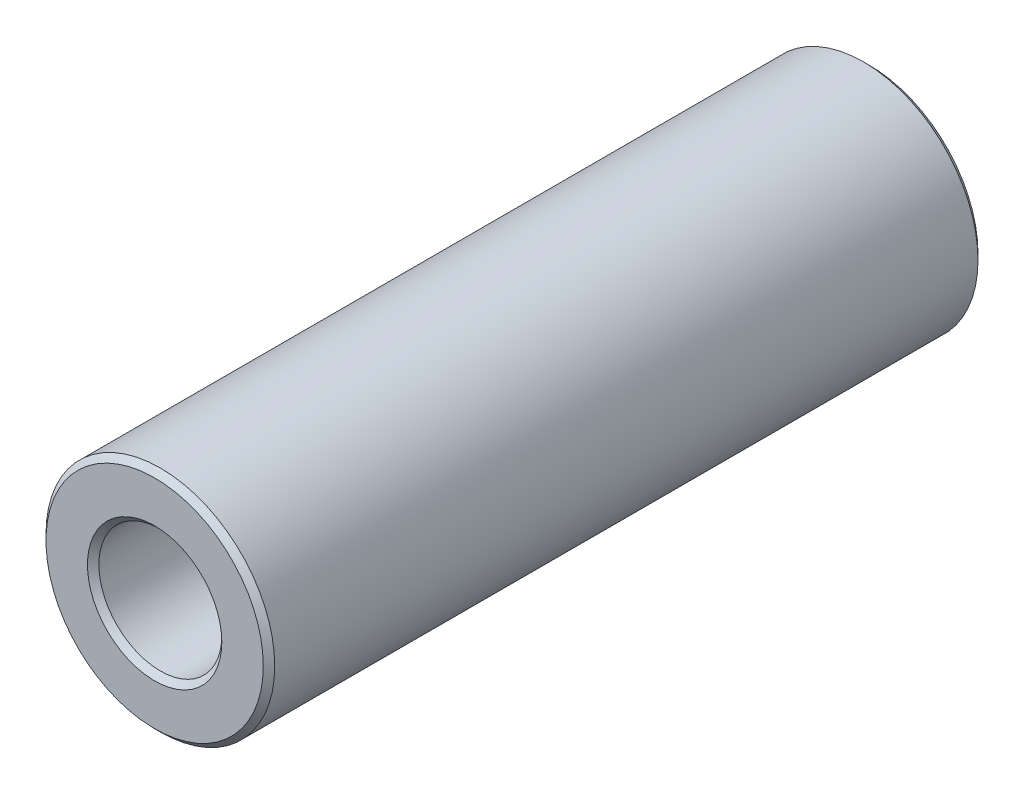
ISO-10303-21;
HEADER;
FILE_DESCRIPTION(('STEP AP214'),'2;1');
FILE_NAME('part.step','',(''),(''),'','','');
FILE_SCHEMA(('AUTOMOTIVE_DESIGN { 1 0 10303 214 1 1 1 1 }'));
ENDSEC;
DATA;
#1=APPLICATION_CONTEXT('core data for automotive mechanical design processes');
#2=APPLICATION_PROTOCOL_DEFINITION('international standard','automotive_design',2000,#1);
#3=PRODUCT_CONTEXT('',#1,'mechanical');
#4=PRODUCT('Part','Part','',(#3));
#5=PRODUCT_RELATED_PRODUCT_CATEGORY('part','',(#4));
#6=PRODUCT_DEFINITION_FORMATION('','',#4);
#7=PRODUCT_DEFINITION_CONTEXT('part definition',#1,'design');
#8=PRODUCT_DEFINITION('design','',#6,#7);
#9=PRODUCT_DEFINITION_SHAPE('','',#8);
#10=(LENGTH_UNIT() NAMED_UNIT(*) SI_UNIT(.MILLI.,.METRE.));
#11=(NAMED_UNIT(*) PLANE_ANGLE_UNIT() SI_UNIT($,.RADIAN.));
#12=(NAMED_UNIT(*) SI_UNIT($,.STERADIAN.) SOLID_ANGLE_UNIT());
#13=UNCERTAINTY_MEASURE_WITH_UNIT(LENGTH_MEASURE(1.E-05),#10,'distance_accuracy_value','');
#14=(GEOMETRIC_REPRESENTATION_CONTEXT(3) GLOBAL_UNCERTAINTY_ASSIGNED_CONTEXT((#13)) GLOBAL_UNIT_ASSIGNED_CONTEXT((#10,
#11,#12)) REPRESENTATION_CONTEXT('',''));
#15=CARTESIAN_POINT('',(0.,0.,0.));
#16=DIRECTION('',(0.,0.,1.));
#17=DIRECTION('',(1.,0.,0.));
#18=AXIS2_PLACEMENT_3D('',#15,#16,#17);
#19=CARTESIAN_POINT('',(0.,0.,12.5));
#20=DIRECTION('',(0.,0.,1.));
#21=DIRECTION('',(1.,0.,0.));
#22=AXIS2_PLACEMENT_3D('',#19,#20,#21);
#23=PLANE('',#22);
#24=CARTESIAN_POINT('',(0.,0.,12.5));
#25=DIRECTION('',(0.,0.,1.));
#26=DIRECTION('',(1.,0.,0.));
#27=AXIS2_PLACEMENT_3D('',#24,#25,#26);
#28=CIRCLE('',#27,2.35);
#29=CARTESIAN_POINT('',(2.35,0.,12.5));
#30=VERTEX_POINT('',#29);
#31=EDGE_CURVE('E10',#30,#30,#28,.F.);
#32=ORIENTED_EDGE('',*,*,#31,.T.);
#33=EDGE_LOOP('',(#32));
#34=FACE_BOUND('',#33,.T.);
#35=CARTESIAN_POINT('',(0.,0.,12.5));
#36=DIRECTION('',(0.,0.,1.));
#37=DIRECTION('',(1.,0.,0.));
#38=AXIS2_PLACEMENT_3D('',#35,#36,#37);
#39=CIRCLE('',#38,3.8);
#40=CARTESIAN_POINT('',(3.8,0.,12.5));
#41=VERTEX_POINT('',#40);
#42=EDGE_CURVE('E45',#41,#41,#39,.T.);
#43=ORIENTED_EDGE('',*,*,#42,.T.);
#44=EDGE_LOOP('',(#43));
#45=FACE_BOUND('',#44,.T.);
#46=ADVANCED_FACE('F37',(#34,#45),#23,.T.);
#47=CARTESIAN_POINT('',(0.,0.,-12.5));
#48=DIRECTION('',(0.,0.,1.));
#49=DIRECTION('',(1.,0.,0.));
#50=AXIS2_PLACEMENT_3D('',#47,#48,#49);
#51=PLANE('',#50);
#52=CARTESIAN_POINT('',(0.,0.,-12.5));
#53=DIRECTION('',(0.,0.,1.));
#54=DIRECTION('',(1.,0.,0.));
#55=AXIS2_PLACEMENT_3D('',#52,#53,#54);
#56=CIRCLE('',#55,3.80000000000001);
#57=CARTESIAN_POINT('',(3.80000000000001,0.,-12.5));
#58=VERTEX_POINT('',#57);
#59=EDGE_CURVE('E62',#58,#58,#56,.F.);
#60=ORIENTED_EDGE('',*,*,#59,.T.);
#61=EDGE_LOOP('',(#60));
#62=FACE_BOUND('',#61,.T.);
#63=CARTESIAN_POINT('',(0.,0.,-12.5));
#64=DIRECTION('',(0.,0.,1.));
#65=DIRECTION('',(1.,0.,0.));
#66=AXIS2_PLACEMENT_3D('',#63,#64,#65);
#67=CIRCLE('',#66,2.35);
#68=CARTESIAN_POINT('',(2.35,0.,-12.5));
#69=VERTEX_POINT('',#68);
#70=EDGE_CURVE('E66',#69,#69,#67,.T.);
#71=ORIENTED_EDGE('',*,*,#70,.T.);
#72=EDGE_LOOP('',(#71));
#73=FACE_BOUND('',#72,.T.);
#74=ADVANCED_FACE('F89',(#62,#73),#51,.F.);
#75=CARTESIAN_POINT('',(0.,0.,12.5));
#76=DIRECTION('',(0.,0.,-1.));
#77=DIRECTION('',(-1.,0.,0.));
#78=AXIS2_PLACEMENT_3D('',#75,#76,#77);
#79=CYLINDRICAL_SURFACE('',#78,4.);
#80=CARTESIAN_POINT('',(0.,0.,-12.3));
#81=DIRECTION('',(0.,0.,1.));
#82=DIRECTION('',(1.,0.,0.));
#83=AXIS2_PLACEMENT_3D('',#80,#81,#82);
#84=CIRCLE('',#83,4.);
#85=CARTESIAN_POINT('',(4.,0.,-12.3));
#86=VERTEX_POINT('',#85);
#87=EDGE_CURVE('E69',#86,#86,#84,.T.);
#88=ORIENTED_EDGE('',*,*,#87,.T.);
#89=EDGE_LOOP('',(#88));
#90=FACE_BOUND('',#89,.T.);
#91=CARTESIAN_POINT('',(0.,0.,12.3));
#92=DIRECTION('',(0.,0.,1.));
#93=DIRECTION('',(1.,0.,0.));
#94=AXIS2_PLACEMENT_3D('',#91,#92,#93);
#95=CIRCLE('',#94,4.);
#96=CARTESIAN_POINT('',(4.,0.,12.3));
#97=VERTEX_POINT('',#96);
#98=EDGE_CURVE('E73',#97,#97,#95,.F.);
#99=ORIENTED_EDGE('',*,*,#98,.T.);
#100=EDGE_LOOP('',(#99));
#101=FACE_BOUND('',#100,.T.);
#102=ADVANCED_FACE('F78',(#90,#101),#79,.T.);
#103=CARTESIAN_POINT('',(0.,0.,12.5));
#104=DIRECTION('',(0.,0.,-1.));
#105=DIRECTION('',(-1.,0.,0.));
#106=AXIS2_PLACEMENT_3D('',#103,#104,#105);
#107=CYLINDRICAL_SURFACE('',#106,2.15);
#108=CARTESIAN_POINT('',(0.,0.,-12.3));
#109=DIRECTION('',(0.,0.,1.));
#110=DIRECTION('',(1.,0.,0.));
#111=AXIS2_PLACEMENT_3D('',#108,#109,#110);
#112=CIRCLE('',#111,2.15);
#113=CARTESIAN_POINT('',(2.15,0.,-12.3));
#114=VERTEX_POINT('',#113);
#115=EDGE_CURVE('E51',#114,#114,#112,.F.);
#116=ORIENTED_EDGE('',*,*,#115,.T.);
#117=EDGE_LOOP('',(#116));
#118=FACE_BOUND('',#117,.T.);
#119=CARTESIAN_POINT('',(0.,0.,12.3));
#120=DIRECTION('',(0.,0.,1.));
#121=DIRECTION('',(1.,0.,0.));
#122=AXIS2_PLACEMENT_3D('',#119,#120,#121);
#123=CIRCLE('',#122,2.15);
#124=CARTESIAN_POINT('',(2.15,0.,12.3));
#125=VERTEX_POINT('',#124);
#126=EDGE_CURVE('E56',#125,#125,#123,.T.);
#127=ORIENTED_EDGE('',*,*,#126,.T.);
#128=EDGE_LOOP('',(#127));
#129=FACE_BOUND('',#128,.T.);
#130=ADVANCED_FACE('F97',(#118,#129),#107,.F.);
#131=CARTESIAN_POINT('',(0.,0.,-12.3));
#132=DIRECTION('',(0.,0.,1.));
#133=DIRECTION('',(1.,0.,0.));
#134=AXIS2_PLACEMENT_3D('',#131,#132,#133);
#135=CONICAL_SURFACE('',#134,4.,0.785398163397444);
#136=ORIENTED_EDGE('',*,*,#59,.F.);
#137=EDGE_LOOP('',(#136));
#138=FACE_BOUND('',#137,.T.);
#139=ORIENTED_EDGE('',*,*,#87,.F.);
#140=EDGE_LOOP('',(#139));
#141=FACE_BOUND('',#140,.T.);
#142=ADVANCED_FACE('F102',(#138,#141),#135,.T.);
#143=CARTESIAN_POINT('',(0.,0.,-12.5));
#144=DIRECTION('',(0.,0.,-1.));
#145=DIRECTION('',(-1.,0.,0.));
#146=AXIS2_PLACEMENT_3D('',#143,#144,#145);
#147=CONICAL_SURFACE('',#146,2.35,0.785398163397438);
#148=ORIENTED_EDGE('',*,*,#115,.F.);
#149=EDGE_LOOP('',(#148));
#150=FACE_BOUND('',#149,.T.);
#151=ORIENTED_EDGE('',*,*,#70,.F.);
#152=EDGE_LOOP('',(#151));
#153=FACE_BOUND('',#152,.T.);
#154=ADVANCED_FACE('F86',(#150,#153),#147,.F.);
#155=CARTESIAN_POINT('',(0.,0.,12.3));
#156=DIRECTION('',(0.,0.,1.));
#157=DIRECTION('',(1.,0.,0.));
#158=AXIS2_PLACEMENT_3D('',#155,#156,#157);
#159=CONICAL_SURFACE('',#158,2.15,0.785398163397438);
#160=ORIENTED_EDGE('',*,*,#31,.F.);
#161=EDGE_LOOP('',(#160));
#162=FACE_BOUND('',#161,.T.);
#163=ORIENTED_EDGE('',*,*,#126,.F.);
#164=EDGE_LOOP('',(#163));
#165=FACE_BOUND('',#164,.T.);
#166=ADVANCED_FACE('F82',(#162,#165),#159,.F.);
#167=CARTESIAN_POINT('',(0.,0.,12.5));
#168=DIRECTION('',(0.,0.,-1.));
#169=DIRECTION('',(-1.,0.,0.));
#170=AXIS2_PLACEMENT_3D('',#167,#168,#169);
#171=CONICAL_SURFACE('',#170,3.8,0.785398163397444);
#172=ORIENTED_EDGE('',*,*,#98,.F.);
#173=EDGE_LOOP('',(#172));
#174=FACE_BOUND('',#173,.T.);
#175=ORIENTED_EDGE('',*,*,#42,.F.);
#176=EDGE_LOOP('',(#175));
#177=FACE_BOUND('',#176,.T.);
#178=ADVANCED_FACE('F39',(#174,#177),#171,.T.);
#179=CLOSED_SHELL('',(#46,#74,#102,#130,#142,#154,#166,#178));
#180=MANIFOLD_SOLID_BREP('B2',#179);
#181=ADVANCED_BREP_SHAPE_REPRESENTATION('',(#18,#180),#14);
#182=SHAPE_DEFINITION_REPRESENTATION(#9,#181);
ENDSEC;
END-ISO-10303-21;
